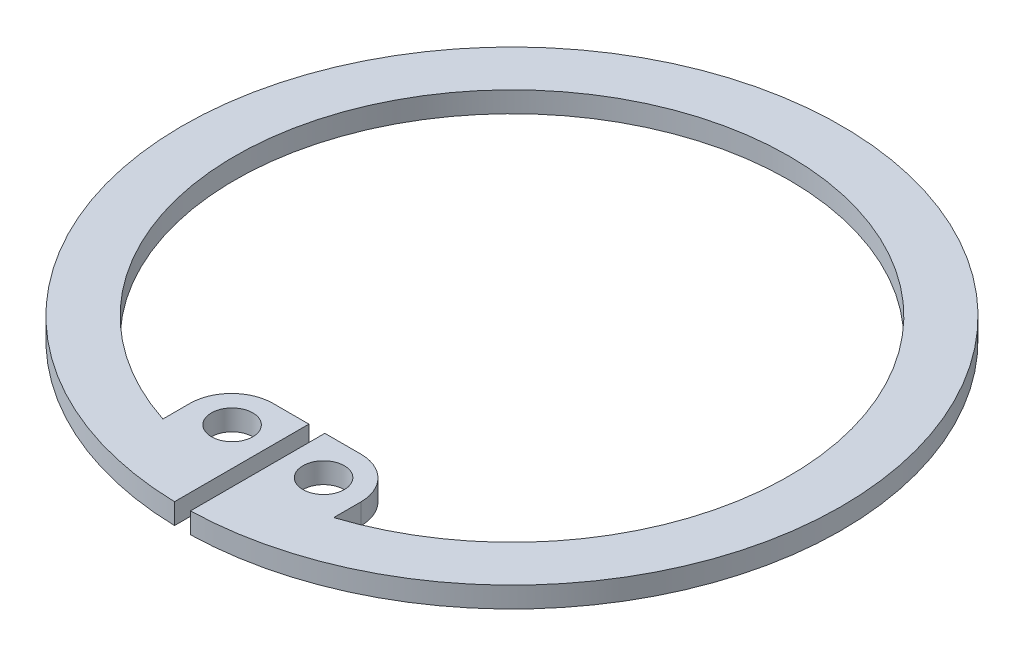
ISO-10303-21;
HEADER;
FILE_DESCRIPTION(('STEP AP214'),'2;1');
FILE_NAME('part.step','',(''),(''),'','','');
FILE_SCHEMA(('AUTOMOTIVE_DESIGN { 1 0 10303 214 1 1 1 1 }'));
ENDSEC;
DATA;
#1=APPLICATION_CONTEXT('core data for automotive mechanical design processes');
#2=APPLICATION_PROTOCOL_DEFINITION('international standard','automotive_design',2000,#1);
#3=PRODUCT_CONTEXT('',#1,'mechanical');
#4=PRODUCT('Part','Part','',(#3));
#5=PRODUCT_RELATED_PRODUCT_CATEGORY('part','',(#4));
#6=PRODUCT_DEFINITION_FORMATION('','',#4);
#7=PRODUCT_DEFINITION_CONTEXT('part definition',#1,'design');
#8=PRODUCT_DEFINITION('design','',#6,#7);
#9=PRODUCT_DEFINITION_SHAPE('','',#8);
#10=(LENGTH_UNIT() NAMED_UNIT(*) SI_UNIT(.MILLI.,.METRE.));
#11=(NAMED_UNIT(*) PLANE_ANGLE_UNIT() SI_UNIT($,.RADIAN.));
#12=(NAMED_UNIT(*) SI_UNIT($,.STERADIAN.) SOLID_ANGLE_UNIT());
#13=UNCERTAINTY_MEASURE_WITH_UNIT(LENGTH_MEASURE(1.E-05),#10,'distance_accuracy_value','');
#14=(GEOMETRIC_REPRESENTATION_CONTEXT(3) GLOBAL_UNCERTAINTY_ASSIGNED_CONTEXT((#13)) GLOBAL_UNIT_ASSIGNED_CONTEXT((#10,
#11,#12)) REPRESENTATION_CONTEXT('',''));
#15=CARTESIAN_POINT('',(0.,0.,0.));
#16=DIRECTION('',(0.,0.,1.));
#17=DIRECTION('',(1.,0.,0.));
#18=AXIS2_PLACEMENT_3D('',#15,#16,#17);
#19=CARTESIAN_POINT('',(0.,3.,0.));
#20=DIRECTION('',(0.,1.,0.));
#21=DIRECTION('',(0.,0.,1.));
#22=AXIS2_PLACEMENT_3D('',#19,#20,#21);
#23=PLANE('',#22);
#24=CARTESIAN_POINT('',(6.62815123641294,3.,33.9170868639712));
#25=DIRECTION('',(0.,1.,0.));
#26=DIRECTION('',(0.,0.,-1.));
#27=AXIS2_PLACEMENT_3D('',#24,#25,#26);
#28=CIRCLE('',#27,3.);
#29=CARTESIAN_POINT('',(6.62815123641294,3.,30.9170868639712));
#30=VERTEX_POINT('',#29);
#31=EDGE_CURVE('E152',#30,#30,#28,.T.);
#32=ORIENTED_EDGE('',*,*,#31,.F.);
#33=EDGE_LOOP('',(#32));
#34=FACE_BOUND('',#33,.T.);
#35=DIRECTION('',(0.,0.,-1.));
#36=VECTOR('',#35,1.);
#37=CARTESIAN_POINT('',(12.3715466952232,3.,38.1964308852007));
#38=LINE('',#37,#36);
#39=CARTESIAN_POINT('',(12.3715466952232,3.,38.1964308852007));
#40=VERTEX_POINT('',#39);
#41=CARTESIAN_POINT('',(12.3715466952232,3.,34.2648564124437));
#42=VERTEX_POINT('',#41);
#43=EDGE_CURVE('E120',#40,#42,#38,.T.);
#44=ORIENTED_EDGE('',*,*,#43,.T.);
#45=CARTESIAN_POINT('',(6.37154669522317,3.,34.2648564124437));
#46=DIRECTION('',(0.,1.,0.));
#47=DIRECTION('',(0.,0.,1.));
#48=AXIS2_PLACEMENT_3D('',#45,#46,#47);
#49=CIRCLE('',#48,6.);
#50=CARTESIAN_POINT('',(6.37154669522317,3.,28.2648564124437));
#51=VERTEX_POINT('',#50);
#52=EDGE_CURVE('E116',#42,#51,#49,.T.);
#53=ORIENTED_EDGE('',*,*,#52,.T.);
#54=DIRECTION('',(-1.,0.,0.));
#55=VECTOR('',#54,1.);
#56=CARTESIAN_POINT('',(12.3715466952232,3.,28.2648564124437));
#57=LINE('',#56,#55);
#58=CARTESIAN_POINT('',(1.15524193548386,3.,28.2648564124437));
#59=VERTEX_POINT('',#58);
#60=EDGE_CURVE('E108',#51,#59,#57,.T.);
#61=ORIENTED_EDGE('',*,*,#60,.T.);
#62=DIRECTION('',(0.,0.,1.));
#63=VECTOR('',#62,1.);
#64=CARTESIAN_POINT('',(1.15524193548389,3.,47.7360232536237));
#65=LINE('',#64,#63);
#66=CARTESIAN_POINT('',(1.15524193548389,3.,47.7360232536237));
#67=VERTEX_POINT('',#66);
#68=EDGE_CURVE('E113',#59,#67,#65,.T.);
#69=ORIENTED_EDGE('',*,*,#68,.T.);
#70=CARTESIAN_POINT('',(0.,3.,0.));
#71=DIRECTION('',(0.,1.,0.));
#72=DIRECTION('',(0.,0.,1.));
#73=AXIS2_PLACEMENT_3D('',#70,#71,#72);
#74=CIRCLE('',#73,47.75);
#75=CARTESIAN_POINT('',(-1.15524193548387,3.,47.7360232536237));
#76=VERTEX_POINT('',#75);
#77=EDGE_CURVE('E135',#67,#76,#74,.T.);
#78=ORIENTED_EDGE('',*,*,#77,.T.);
#79=DIRECTION('',(0.,0.,-1.));
#80=VECTOR('',#79,1.);
#81=CARTESIAN_POINT('',(-1.15524193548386,3.,47.7360232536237));
#82=LINE('',#81,#80);
#83=CARTESIAN_POINT('',(-1.15524193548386,3.,28.2648564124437));
#84=VERTEX_POINT('',#83);
#85=EDGE_CURVE('E137',#76,#84,#82,.T.);
#86=ORIENTED_EDGE('',*,*,#85,.T.);
#87=DIRECTION('',(-1.,0.,0.));
#88=VECTOR('',#87,1.);
#89=CARTESIAN_POINT('',(-12.3715466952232,3.,28.2648564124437));
#90=LINE('',#89,#88);
#91=CARTESIAN_POINT('',(-6.37154669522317,3.,28.2648564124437));
#92=VERTEX_POINT('',#91);
#93=EDGE_CURVE('E142',#84,#92,#90,.T.);
#94=ORIENTED_EDGE('',*,*,#93,.T.);
#95=CARTESIAN_POINT('',(-6.37154669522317,3.,34.2648564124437));
#96=DIRECTION('',(0.,1.,0.));
#97=DIRECTION('',(0.,0.,1.));
#98=AXIS2_PLACEMENT_3D('',#95,#96,#97);
#99=CIRCLE('',#98,6.);
#100=CARTESIAN_POINT('',(-12.3715466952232,3.,34.2648564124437));
#101=VERTEX_POINT('',#100);
#102=EDGE_CURVE('E48',#92,#101,#99,.T.);
#103=ORIENTED_EDGE('',*,*,#102,.T.);
#104=DIRECTION('',(0.,0.,1.));
#105=VECTOR('',#104,1.);
#106=CARTESIAN_POINT('',(-12.3715466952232,3.,38.1964308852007));
#107=LINE('',#106,#105);
#108=CARTESIAN_POINT('',(-12.3715466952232,3.,38.1964308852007));
#109=VERTEX_POINT('',#108);
#110=EDGE_CURVE('E144',#101,#109,#107,.T.);
#111=ORIENTED_EDGE('',*,*,#110,.T.);
#112=CARTESIAN_POINT('',(0.,3.,0.));
#113=DIRECTION('',(0.,-1.,0.));
#114=DIRECTION('',(0.,0.,1.));
#115=AXIS2_PLACEMENT_3D('',#112,#113,#114);
#116=CIRCLE('',#115,40.15);
#117=EDGE_CURVE('E146',#109,#40,#116,.T.);
#118=ORIENTED_EDGE('',*,*,#117,.T.);
#119=EDGE_LOOP('',(#44,#53,#61,#69,#78,#86,#94,#103,#111,#118));
#120=FACE_BOUND('',#119,.T.);
#121=CARTESIAN_POINT('',(-6.62815123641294,3.,33.9170868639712));
#122=DIRECTION('',(0.,1.,0.));
#123=DIRECTION('',(0.,0.,1.));
#124=AXIS2_PLACEMENT_3D('',#121,#122,#123);
#125=CIRCLE('',#124,3.);
#126=CARTESIAN_POINT('',(-6.62815123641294,3.,36.9170868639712));
#127=VERTEX_POINT('',#126);
#128=EDGE_CURVE('E211',#127,#127,#125,.T.);
#129=ORIENTED_EDGE('',*,*,#128,.F.);
#130=EDGE_LOOP('',(#129));
#131=FACE_BOUND('',#130,.T.);
#132=ADVANCED_FACE('F33',(#34,#120,#131),#23,.T.);
#133=CARTESIAN_POINT('',(0.,0.,0.));
#134=DIRECTION('',(0.,1.,0.));
#135=DIRECTION('',(0.,0.,1.));
#136=AXIS2_PLACEMENT_3D('',#133,#134,#135);
#137=PLANE('',#136);
#138=CARTESIAN_POINT('',(6.62815123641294,0.,33.9170868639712));
#139=DIRECTION('',(0.,1.,0.));
#140=DIRECTION('',(0.,0.,-1.));
#141=AXIS2_PLACEMENT_3D('',#138,#139,#140);
#142=CIRCLE('',#141,3.);
#143=CARTESIAN_POINT('',(6.62815123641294,0.,30.9170868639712));
#144=VERTEX_POINT('',#143);
#145=EDGE_CURVE('E208',#144,#144,#142,.T.);
#146=ORIENTED_EDGE('',*,*,#145,.T.);
#147=EDGE_LOOP('',(#146));
#148=FACE_BOUND('',#147,.T.);
#149=DIRECTION('',(-1.,0.,0.));
#150=VECTOR('',#149,1.);
#151=CARTESIAN_POINT('',(12.3715466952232,0.,28.2648564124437));
#152=LINE('',#151,#150);
#153=CARTESIAN_POINT('',(6.37154669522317,0.,28.2648564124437));
#154=VERTEX_POINT('',#153);
#155=CARTESIAN_POINT('',(1.15524193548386,0.,28.2648564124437));
#156=VERTEX_POINT('',#155);
#157=EDGE_CURVE('E126',#154,#156,#152,.T.);
#158=ORIENTED_EDGE('',*,*,#157,.F.);
#159=CARTESIAN_POINT('',(6.37154669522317,0.,34.2648564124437));
#160=DIRECTION('',(0.,1.,0.));
#161=DIRECTION('',(0.,0.,1.));
#162=AXIS2_PLACEMENT_3D('',#159,#160,#161);
#163=CIRCLE('',#162,6.);
#164=CARTESIAN_POINT('',(12.3715466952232,0.,34.2648564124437));
#165=VERTEX_POINT('',#164);
#166=EDGE_CURVE('E181',#154,#165,#163,.F.);
#167=ORIENTED_EDGE('',*,*,#166,.T.);
#168=DIRECTION('',(0.,0.,-1.));
#169=VECTOR('',#168,1.);
#170=CARTESIAN_POINT('',(12.3715466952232,0.,38.1964308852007));
#171=LINE('',#170,#169);
#172=CARTESIAN_POINT('',(12.3715466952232,0.,38.1964308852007));
#173=VERTEX_POINT('',#172);
#174=EDGE_CURVE('E149',#173,#165,#171,.T.);
#175=ORIENTED_EDGE('',*,*,#174,.F.);
#176=CARTESIAN_POINT('',(0.,0.,0.));
#177=DIRECTION('',(0.,-1.,0.));
#178=DIRECTION('',(0.,0.,1.));
#179=AXIS2_PLACEMENT_3D('',#176,#177,#178);
#180=CIRCLE('',#179,40.15);
#181=CARTESIAN_POINT('',(-12.3715466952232,0.,38.1964308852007));
#182=VERTEX_POINT('',#181);
#183=EDGE_CURVE('E164',#182,#173,#180,.T.);
#184=ORIENTED_EDGE('',*,*,#183,.F.);
#185=DIRECTION('',(0.,0.,1.));
#186=VECTOR('',#185,1.);
#187=CARTESIAN_POINT('',(-12.3715466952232,0.,38.1964308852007));
#188=LINE('',#187,#186);
#189=CARTESIAN_POINT('',(-12.3715466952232,0.,34.2648564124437));
#190=VERTEX_POINT('',#189);
#191=EDGE_CURVE('E162',#190,#182,#188,.T.);
#192=ORIENTED_EDGE('',*,*,#191,.F.);
#193=CARTESIAN_POINT('',(-6.37154669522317,0.,34.2648564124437));
#194=DIRECTION('',(0.,1.,0.));
#195=DIRECTION('',(0.,0.,1.));
#196=AXIS2_PLACEMENT_3D('',#193,#194,#195);
#197=CIRCLE('',#196,6.);
#198=CARTESIAN_POINT('',(-6.37154669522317,0.,28.2648564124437));
#199=VERTEX_POINT('',#198);
#200=EDGE_CURVE('E179',#190,#199,#197,.F.);
#201=ORIENTED_EDGE('',*,*,#200,.T.);
#202=DIRECTION('',(-1.,0.,0.));
#203=VECTOR('',#202,1.);
#204=CARTESIAN_POINT('',(-12.3715466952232,0.,28.2648564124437));
#205=LINE('',#204,#203);
#206=CARTESIAN_POINT('',(-1.15524193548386,0.,28.2648564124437));
#207=VERTEX_POINT('',#206);
#208=EDGE_CURVE('E160',#207,#199,#205,.T.);
#209=ORIENTED_EDGE('',*,*,#208,.F.);
#210=DIRECTION('',(0.,0.,-1.));
#211=VECTOR('',#210,1.);
#212=CARTESIAN_POINT('',(-1.15524193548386,0.,47.7360232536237));
#213=LINE('',#212,#211);
#214=CARTESIAN_POINT('',(-1.15524193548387,0.,47.7360232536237));
#215=VERTEX_POINT('',#214);
#216=EDGE_CURVE('E158',#215,#207,#213,.T.);
#217=ORIENTED_EDGE('',*,*,#216,.F.);
#218=CARTESIAN_POINT('',(0.,0.,0.));
#219=DIRECTION('',(0.,1.,0.));
#220=DIRECTION('',(0.,0.,1.));
#221=AXIS2_PLACEMENT_3D('',#218,#219,#220);
#222=CIRCLE('',#221,47.75);
#223=CARTESIAN_POINT('',(1.15524193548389,0.,47.7360232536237));
#224=VERTEX_POINT('',#223);
#225=EDGE_CURVE('E156',#224,#215,#222,.T.);
#226=ORIENTED_EDGE('',*,*,#225,.F.);
#227=DIRECTION('',(0.,0.,1.));
#228=VECTOR('',#227,1.);
#229=CARTESIAN_POINT('',(1.15524193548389,0.,47.7360232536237));
#230=LINE('',#229,#228);
#231=EDGE_CURVE('E154',#156,#224,#230,.T.);
#232=ORIENTED_EDGE('',*,*,#231,.F.);
#233=EDGE_LOOP('',(#158,#167,#175,#184,#192,#201,#209,#217,#226,#232));
#234=FACE_BOUND('',#233,.T.);
#235=CARTESIAN_POINT('',(-6.62815123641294,0.,33.9170868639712));
#236=DIRECTION('',(0.,1.,0.));
#237=DIRECTION('',(0.,0.,1.));
#238=AXIS2_PLACEMENT_3D('',#235,#236,#237);
#239=CIRCLE('',#238,3.);
#240=CARTESIAN_POINT('',(-6.62815123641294,0.,36.9170868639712));
#241=VERTEX_POINT('',#240);
#242=EDGE_CURVE('E214',#241,#241,#239,.T.);
#243=ORIENTED_EDGE('',*,*,#242,.T.);
#244=EDGE_LOOP('',(#243));
#245=FACE_BOUND('',#244,.T.);
#246=ADVANCED_FACE('F195',(#148,#234,#245),#137,.F.);
#247=CARTESIAN_POINT('',(12.3715466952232,3.,38.1964308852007));
#248=DIRECTION('',(-1.,0.,0.));
#249=DIRECTION('',(0.,0.,1.));
#250=AXIS2_PLACEMENT_3D('',#247,#248,#249);
#251=PLANE('',#250);
#252=ORIENTED_EDGE('',*,*,#174,.T.);
#253=DIRECTION('',(0.,-1.,0.));
#254=VECTOR('',#253,1.);
#255=CARTESIAN_POINT('',(12.3715466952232,3.,34.2648564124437));
#256=LINE('',#255,#254);
#257=EDGE_CURVE('E183',#165,#42,#256,.F.);
#258=ORIENTED_EDGE('',*,*,#257,.T.);
#259=ORIENTED_EDGE('',*,*,#43,.F.);
#260=DIRECTION('',(0.,-1.,0.));
#261=VECTOR('',#260,1.);
#262=CARTESIAN_POINT('',(12.3715466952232,3.,38.1964308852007));
#263=LINE('',#262,#261);
#264=EDGE_CURVE('E148',#40,#173,#263,.T.);
#265=ORIENTED_EDGE('',*,*,#264,.T.);
#266=EDGE_LOOP('',(#252,#258,#259,#265));
#267=FACE_BOUND('',#266,.T.);
#268=ADVANCED_FACE('F205',(#267),#251,.F.);
#269=CARTESIAN_POINT('',(12.3715466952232,3.,28.2648564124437));
#270=DIRECTION('',(0.,0.,1.));
#271=DIRECTION('',(1.,0.,0.));
#272=AXIS2_PLACEMENT_3D('',#269,#270,#271);
#273=PLANE('',#272);
#274=ORIENTED_EDGE('',*,*,#60,.F.);
#275=DIRECTION('',(0.,-1.,0.));
#276=VECTOR('',#275,1.);
#277=CARTESIAN_POINT('',(6.37154669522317,3.,28.2648564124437));
#278=LINE('',#277,#276);
#279=EDGE_CURVE('E129',#51,#154,#278,.T.);
#280=ORIENTED_EDGE('',*,*,#279,.T.);
#281=ORIENTED_EDGE('',*,*,#157,.T.);
#282=DIRECTION('',(0.,-1.,0.));
#283=VECTOR('',#282,1.);
#284=CARTESIAN_POINT('',(1.15524193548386,3.,28.2648564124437));
#285=LINE('',#284,#283);
#286=EDGE_CURVE('E123',#59,#156,#285,.T.);
#287=ORIENTED_EDGE('',*,*,#286,.F.);
#288=EDGE_LOOP('',(#274,#280,#281,#287));
#289=FACE_BOUND('',#288,.T.);
#290=ADVANCED_FACE('F124',(#289),#273,.F.);
#291=CARTESIAN_POINT('',(1.15524193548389,3.,47.7360232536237));
#292=DIRECTION('',(1.,0.,0.));
#293=DIRECTION('',(0.,0.,-1.));
#294=AXIS2_PLACEMENT_3D('',#291,#292,#293);
#295=PLANE('',#294);
#296=ORIENTED_EDGE('',*,*,#231,.T.);
#297=DIRECTION('',(0.,-1.,0.));
#298=VECTOR('',#297,1.);
#299=CARTESIAN_POINT('',(1.15524193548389,3.,47.7360232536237));
#300=LINE('',#299,#298);
#301=EDGE_CURVE('E130',#67,#224,#300,.T.);
#302=ORIENTED_EDGE('',*,*,#301,.F.);
#303=ORIENTED_EDGE('',*,*,#68,.F.);
#304=ORIENTED_EDGE('',*,*,#286,.T.);
#305=EDGE_LOOP('',(#296,#302,#303,#304));
#306=FACE_BOUND('',#305,.T.);
#307=ADVANCED_FACE('F132',(#306),#295,.F.);
#308=CARTESIAN_POINT('',(0.,3.,0.));
#309=DIRECTION('',(0.,-1.,0.));
#310=DIRECTION('',(0.,0.,-1.));
#311=AXIS2_PLACEMENT_3D('',#308,#309,#310);
#312=CYLINDRICAL_SURFACE('',#311,47.75);
#313=ORIENTED_EDGE('',*,*,#225,.T.);
#314=DIRECTION('',(0.,-1.,0.));
#315=VECTOR('',#314,1.);
#316=CARTESIAN_POINT('',(-1.15524193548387,3.,47.7360232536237));
#317=LINE('',#316,#315);
#318=EDGE_CURVE('E174',#76,#215,#317,.T.);
#319=ORIENTED_EDGE('',*,*,#318,.F.);
#320=ORIENTED_EDGE('',*,*,#77,.F.);
#321=ORIENTED_EDGE('',*,*,#301,.T.);
#322=EDGE_LOOP('',(#313,#319,#320,#321));
#323=FACE_BOUND('',#322,.T.);
#324=ADVANCED_FACE('F245',(#323),#312,.T.);
#325=CARTESIAN_POINT('',(-1.15524193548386,3.,47.7360232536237));
#326=DIRECTION('',(-1.,0.,0.));
#327=DIRECTION('',(0.,0.,1.));
#328=AXIS2_PLACEMENT_3D('',#325,#326,#327);
#329=PLANE('',#328);
#330=ORIENTED_EDGE('',*,*,#216,.T.);
#331=DIRECTION('',(0.,-1.,0.));
#332=VECTOR('',#331,1.);
#333=CARTESIAN_POINT('',(-1.15524193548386,3.,28.2648564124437));
#334=LINE('',#333,#332);
#335=EDGE_CURVE('E171',#84,#207,#334,.T.);
#336=ORIENTED_EDGE('',*,*,#335,.F.);
#337=ORIENTED_EDGE('',*,*,#85,.F.);
#338=ORIENTED_EDGE('',*,*,#318,.T.);
#339=EDGE_LOOP('',(#330,#336,#337,#338));
#340=FACE_BOUND('',#339,.T.);
#341=ADVANCED_FACE('F242',(#340),#329,.F.);
#342=CARTESIAN_POINT('',(-12.3715466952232,3.,28.2648564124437));
#343=DIRECTION('',(0.,0.,1.));
#344=DIRECTION('',(1.,0.,0.));
#345=AXIS2_PLACEMENT_3D('',#342,#343,#344);
#346=PLANE('',#345);
#347=ORIENTED_EDGE('',*,*,#208,.T.);
#348=DIRECTION('',(0.,-1.,0.));
#349=VECTOR('',#348,1.);
#350=CARTESIAN_POINT('',(-6.37154669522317,3.,28.2648564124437));
#351=LINE('',#350,#349);
#352=EDGE_CURVE('E11',#199,#92,#351,.F.);
#353=ORIENTED_EDGE('',*,*,#352,.T.);
#354=ORIENTED_EDGE('',*,*,#93,.F.);
#355=ORIENTED_EDGE('',*,*,#335,.T.);
#356=EDGE_LOOP('',(#347,#353,#354,#355));
#357=FACE_BOUND('',#356,.T.);
#358=ADVANCED_FACE('F239',(#357),#346,.F.);
#359=CARTESIAN_POINT('',(-12.3715466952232,3.,38.1964308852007));
#360=DIRECTION('',(1.,0.,0.));
#361=DIRECTION('',(0.,0.,-1.));
#362=AXIS2_PLACEMENT_3D('',#359,#360,#361);
#363=PLANE('',#362);
#364=ORIENTED_EDGE('',*,*,#110,.F.);
#365=DIRECTION('',(0.,-1.,0.));
#366=VECTOR('',#365,1.);
#367=CARTESIAN_POINT('',(-12.3715466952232,3.,34.2648564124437));
#368=LINE('',#367,#366);
#369=EDGE_CURVE('E41',#101,#190,#368,.T.);
#370=ORIENTED_EDGE('',*,*,#369,.T.);
#371=ORIENTED_EDGE('',*,*,#191,.T.);
#372=DIRECTION('',(0.,-1.,0.));
#373=VECTOR('',#372,1.);
#374=CARTESIAN_POINT('',(-12.3715466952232,3.,38.1964308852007));
#375=LINE('',#374,#373);
#376=EDGE_CURVE('E168',#109,#182,#375,.T.);
#377=ORIENTED_EDGE('',*,*,#376,.F.);
#378=EDGE_LOOP('',(#364,#370,#371,#377));
#379=FACE_BOUND('',#378,.T.);
#380=ADVANCED_FACE('F190',(#379),#363,.F.);
#381=CARTESIAN_POINT('',(0.,3.,0.));
#382=DIRECTION('',(0.,-1.,0.));
#383=DIRECTION('',(0.,0.,-1.));
#384=AXIS2_PLACEMENT_3D('',#381,#382,#383);
#385=CYLINDRICAL_SURFACE('',#384,40.15);
#386=ORIENTED_EDGE('',*,*,#183,.T.);
#387=ORIENTED_EDGE('',*,*,#264,.F.);
#388=ORIENTED_EDGE('',*,*,#117,.F.);
#389=ORIENTED_EDGE('',*,*,#376,.T.);
#390=EDGE_LOOP('',(#386,#387,#388,#389));
#391=FACE_BOUND('',#390,.T.);
#392=ADVANCED_FACE('F201',(#391),#385,.F.);
#393=CARTESIAN_POINT('',(6.62815123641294,3.,33.9170868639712));
#394=DIRECTION('',(0.,-1.,0.));
#395=DIRECTION('',(0.,0.,-1.));
#396=AXIS2_PLACEMENT_3D('',#393,#394,#395);
#397=CYLINDRICAL_SURFACE('',#396,3.);
#398=ORIENTED_EDGE('',*,*,#31,.T.);
#399=EDGE_LOOP('',(#398));
#400=FACE_BOUND('',#399,.T.);
#401=ORIENTED_EDGE('',*,*,#145,.F.);
#402=EDGE_LOOP('',(#401));
#403=FACE_BOUND('',#402,.T.);
#404=ADVANCED_FACE('F232',(#400,#403),#397,.F.);
#405=CARTESIAN_POINT('',(-6.62815123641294,3.,33.9170868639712));
#406=DIRECTION('',(0.,-1.,0.));
#407=DIRECTION('',(0.,0.,-1.));
#408=AXIS2_PLACEMENT_3D('',#405,#406,#407);
#409=CYLINDRICAL_SURFACE('',#408,3.);
#410=ORIENTED_EDGE('',*,*,#128,.T.);
#411=EDGE_LOOP('',(#410));
#412=FACE_BOUND('',#411,.T.);
#413=ORIENTED_EDGE('',*,*,#242,.F.);
#414=EDGE_LOOP('',(#413));
#415=FACE_BOUND('',#414,.T.);
#416=ADVANCED_FACE('F220',(#412,#415),#409,.F.);
#417=CARTESIAN_POINT('',(6.37154669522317,3.,34.2648564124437));
#418=DIRECTION('',(0.,-1.,0.));
#419=DIRECTION('',(0.,0.,-1.));
#420=AXIS2_PLACEMENT_3D('',#417,#418,#419);
#421=CYLINDRICAL_SURFACE('',#420,6.);
#422=ORIENTED_EDGE('',*,*,#52,.F.);
#423=ORIENTED_EDGE('',*,*,#257,.F.);
#424=ORIENTED_EDGE('',*,*,#166,.F.);
#425=ORIENTED_EDGE('',*,*,#279,.F.);
#426=EDGE_LOOP('',(#422,#423,#424,#425));
#427=FACE_BOUND('',#426,.T.);
#428=ADVANCED_FACE('F255',(#427),#421,.T.);
#429=CARTESIAN_POINT('',(-6.37154669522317,3.,34.2648564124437));
#430=DIRECTION('',(0.,-1.,0.));
#431=DIRECTION('',(0.,0.,-1.));
#432=AXIS2_PLACEMENT_3D('',#429,#430,#431);
#433=CYLINDRICAL_SURFACE('',#432,6.);
#434=ORIENTED_EDGE('',*,*,#102,.F.);
#435=ORIENTED_EDGE('',*,*,#352,.F.);
#436=ORIENTED_EDGE('',*,*,#200,.F.);
#437=ORIENTED_EDGE('',*,*,#369,.F.);
#438=EDGE_LOOP('',(#434,#435,#436,#437));
#439=FACE_BOUND('',#438,.T.);
#440=ADVANCED_FACE('F35',(#439),#433,.T.);
#441=CLOSED_SHELL('',(#132,#246,#268,#290,#307,#324,#341,#358,#380,#392,#404,#416,#428,#440));
#442=MANIFOLD_SOLID_BREP('B2',#441);
#443=ADVANCED_BREP_SHAPE_REPRESENTATION('',(#18,#442),#14);
#444=SHAPE_DEFINITION_REPRESENTATION(#9,#443);
ENDSEC;
END-ISO-10303-21;
